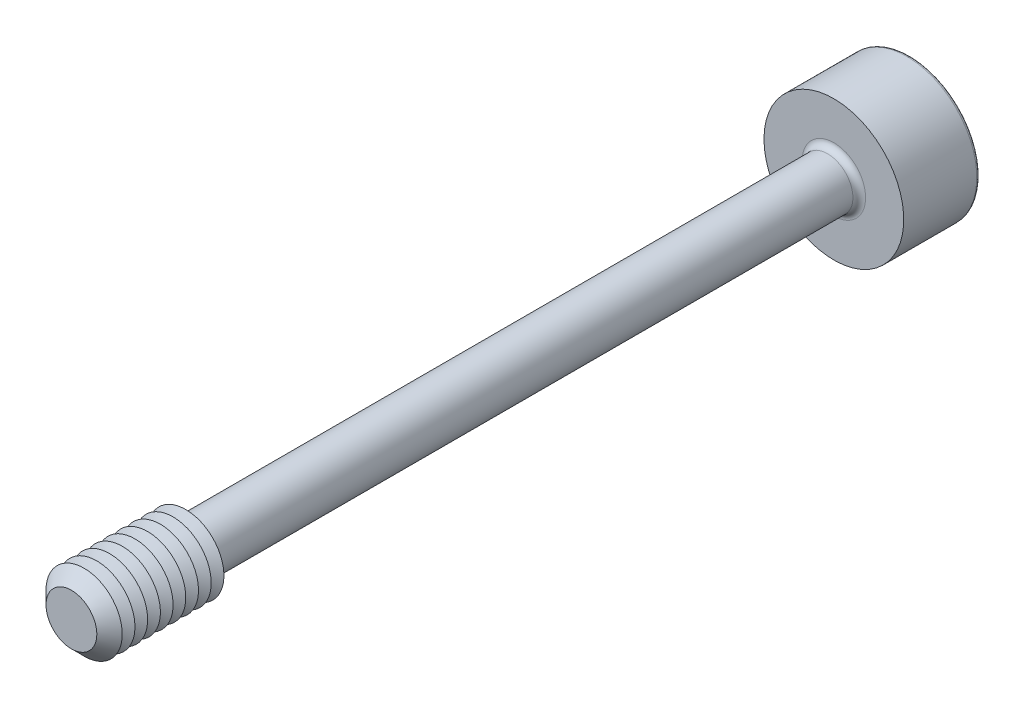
from build123d import *

# Parameters (mm, degrees)
SKETCH1_R       = 1
EXTRUDE1_DEPTH  = 15
CHAMFER1_SIZE   = 0.5
SKETCH3_R       = 2.75
EXTRUDE2_DEPTH  = 3
EXTRUDE3_DEPTH  = 2.5
FILLET1_R       = 0.25
FILLET2_R       = 0.125
LPATTERN1_COUNT = 8
LPATTERN1_PITCH = 0.5


with BuildPart() as part:
    # Sketch1 → Extrude1 (new, symmetric)
    with BuildSketch(Plane.XY):
        Circle(SKETCH1_R)
    extrude(amount=EXTRUDE1_DEPTH, both=True)

    # Sketch2 → Revolve1 (revolve)
    with BuildSketch(Plane(origin=(0, 0, 0), x_dir=(0, 0, -1), z_dir=(1, 0, 0))):
        Polygon((-15, 0), (-15, 1.5), (-10.5, 1.5), (-10.211324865, 1), (-10.211324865, 0), align=None)
    revolve(axis=Axis((0, 0, 10.211324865), (0, 0, 1)))

    # Chamfer1
    chamfer1_edges = [part.edges().sort_by_distance(p)[0] for p in [
        (0, -1.5, 15),
    ]]
    chamfer(chamfer1_edges, length=CHAMFER1_SIZE)

    # Sketch3 → Extrude2 (add)
    with BuildSketch(Plane(origin=(0, 0, -15), x_dir=(-1, 0, 0), z_dir=(0, 0, -1))):
        Circle(SKETCH3_R)
    extrude(amount=EXTRUDE2_DEPTH)

    # Sketch4 → Extrude3 (cut)
    with BuildSketch(Plane(origin=(-13.7, 0, -18), x_dir=(1, 0, 0), z_dir=(0, 0, 1))):
        Polygon((12.978312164, -1.25), (14.421687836, -1.25), (15.143375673, 0), (14.421687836, 1.25), (12.978312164, 1.25), (12.256624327, 0), align=None)
    extrude(amount=EXTRUDE3_DEPTH, mode=Mode.SUBTRACT)

    # Fillet1
    fillet1_edges = [part.edges().sort_by_distance(p)[0] for p in [
        (-1, 0, -15),
    ]]
    fillet(fillet1_edges, radius=FILLET1_R)

    # Fillet2
    fillet2_edges = [part.edges().sort_by_distance(p)[0] for p in [
        (2.75, 0, -18),
    ]]
    fillet(fillet2_edges, radius=FILLET2_R)

    # Sketch5 → Cut-Revolve1 (revolve, cut)
    with BuildSketch(Plane(origin=(0, 0, 0), x_dir=(0, 0, -1), z_dir=(1, 0, 0)), mode=Mode.PRIVATE) as cut_revolve1_sk:
        Polygon((15.5, 0), (15.5, -1.25), (14.778312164, 0), align=None)
    revolve(cut_revolve1_sk.sketch.rotate(Axis((0, 0, -14.778312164), (0, 0, -1)), 90), axis=Axis((0, 0, -14.778312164), (0, 0, -1)), mode=Mode.SUBTRACT)

    # Sketch7 → Cut-Revolve2 (revolve, cut)
    with BuildSketch(Plane(origin=(0, 0, 0), x_dir=(0, 0, -1), z_dir=(1, 0, 0)), mode=Mode.PRIVATE) as cut_revolve2_sk:
        Polygon((-10.5, 1.5), (-10.75, 1.066987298), (-11, 1.5), align=None)
    cut_revolve2 = revolve(cut_revolve2_sk.sketch.rotate(Axis((0, 0, -1.332048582), (0, 0, 1)), 90), axis=Axis((0, 0, -1.332048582), (0, 0, 1)), mode=Mode.SUBTRACT)

    # LPattern1: Cut-Revolve2 ×8
    with Locations(*[(0, 0, i * LPATTERN1_PITCH) for i in range(1, LPATTERN1_COUNT)]):
        add(cut_revolve2, mode=Mode.SUBTRACT)


solid = part.part
